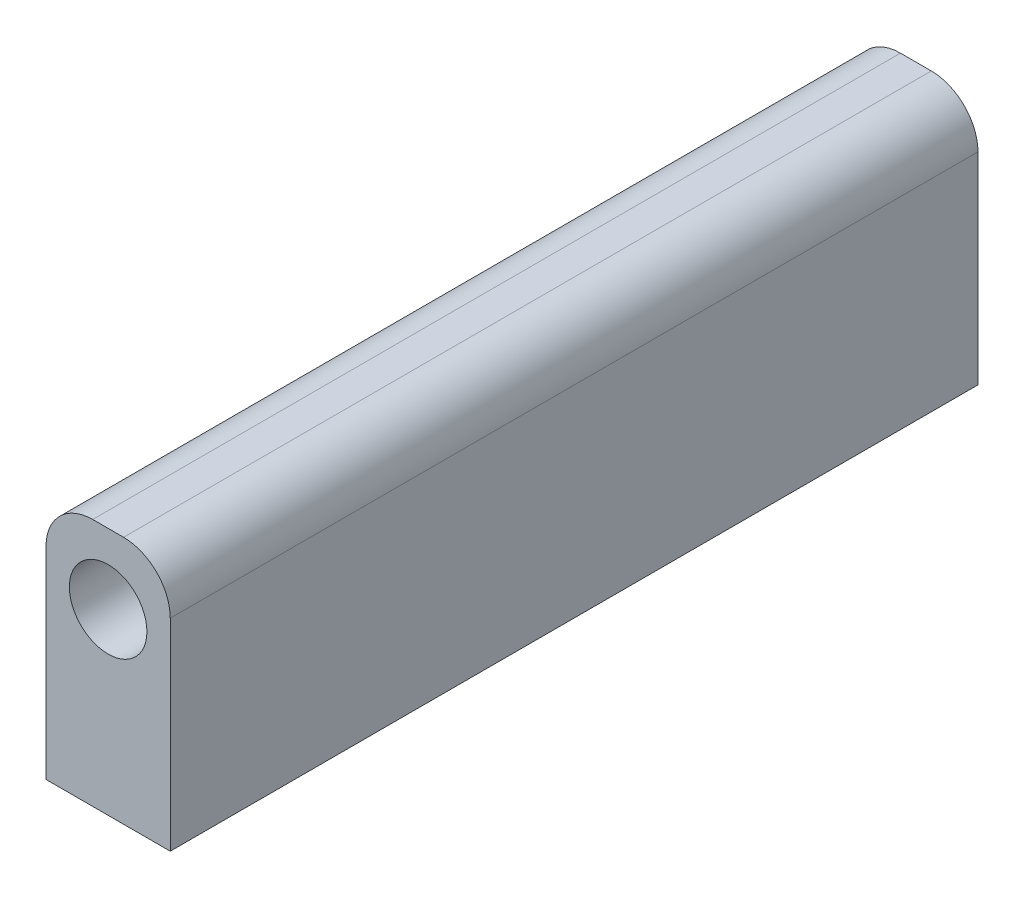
ISO-10303-21;
HEADER;
FILE_DESCRIPTION(('STEP AP214'),'2;1');
FILE_NAME('part.step','',(''),(''),'','','');
FILE_SCHEMA(('AUTOMOTIVE_DESIGN { 1 0 10303 214 1 1 1 1 }'));
ENDSEC;
DATA;
#1=APPLICATION_CONTEXT('core data for automotive mechanical design processes');
#2=APPLICATION_PROTOCOL_DEFINITION('international standard','automotive_design',2000,#1);
#3=PRODUCT_CONTEXT('',#1,'mechanical');
#4=PRODUCT('Part','Part','',(#3));
#5=PRODUCT_RELATED_PRODUCT_CATEGORY('part','',(#4));
#6=PRODUCT_DEFINITION_FORMATION('','',#4);
#7=PRODUCT_DEFINITION_CONTEXT('part definition',#1,'design');
#8=PRODUCT_DEFINITION('design','',#6,#7);
#9=PRODUCT_DEFINITION_SHAPE('','',#8);
#10=(LENGTH_UNIT() NAMED_UNIT(*) SI_UNIT(.MILLI.,.METRE.));
#11=(NAMED_UNIT(*) PLANE_ANGLE_UNIT() SI_UNIT($,.RADIAN.));
#12=(NAMED_UNIT(*) SI_UNIT($,.STERADIAN.) SOLID_ANGLE_UNIT());
#13=UNCERTAINTY_MEASURE_WITH_UNIT(LENGTH_MEASURE(1.E-05),#10,'distance_accuracy_value','');
#14=(GEOMETRIC_REPRESENTATION_CONTEXT(3) GLOBAL_UNCERTAINTY_ASSIGNED_CONTEXT((#13)) GLOBAL_UNIT_ASSIGNED_CONTEXT((#10,
#11,#12)) REPRESENTATION_CONTEXT('',''));
#15=CARTESIAN_POINT('',(0.,0.,0.));
#16=DIRECTION('',(0.,0.,1.));
#17=DIRECTION('',(1.,0.,0.));
#18=AXIS2_PLACEMENT_3D('',#15,#16,#17);
#19=CARTESIAN_POINT('',(0.,0.,41.275));
#20=DIRECTION('',(0.,1.,0.));
#21=DIRECTION('',(0.,0.,1.));
#22=AXIS2_PLACEMENT_3D('',#19,#20,#21);
#23=PLANE('',#22);
#24=CARTESIAN_POINT('',(0.,0.,31.75));
#25=DIRECTION('',(0.,1.,0.));
#26=DIRECTION('',(0.,0.,1.));
#27=AXIS2_PLACEMENT_3D('',#24,#25,#26);
#28=CIRCLE('',#27,3.9624);
#29=CARTESIAN_POINT('',(0.,0.,35.7124));
#30=VERTEX_POINT('',#29);
#31=EDGE_CURVE('E130',#30,#30,#28,.T.);
#32=ORIENTED_EDGE('',*,*,#31,.T.);
#33=EDGE_LOOP('',(#32));
#34=FACE_BOUND('',#33,.T.);
#35=DIRECTION('',(1.,0.,0.));
#36=VECTOR('',#35,1.);
#37=CARTESIAN_POINT('',(0.,0.,-41.275));
#38=LINE('',#37,#36);
#39=CARTESIAN_POINT('',(-6.35,0.,-41.275));
#40=VERTEX_POINT('',#39);
#41=CARTESIAN_POINT('',(6.35,0.,-41.275));
#42=VERTEX_POINT('',#41);
#43=EDGE_CURVE('E174',#40,#42,#38,.T.);
#44=ORIENTED_EDGE('',*,*,#43,.T.);
#45=DIRECTION('',(0.,0.,-1.));
#46=VECTOR('',#45,1.);
#47=CARTESIAN_POINT('',(6.35,0.,41.275));
#48=LINE('',#47,#46);
#49=CARTESIAN_POINT('',(6.35,0.,41.275));
#50=VERTEX_POINT('',#49);
#51=EDGE_CURVE('E173',#50,#42,#48,.T.);
#52=ORIENTED_EDGE('',*,*,#51,.F.);
#53=DIRECTION('',(1.,0.,0.));
#54=VECTOR('',#53,1.);
#55=CARTESIAN_POINT('',(-6.35,0.,41.275));
#56=LINE('',#55,#54);
#57=CARTESIAN_POINT('',(-6.35,0.,41.275));
#58=VERTEX_POINT('',#57);
#59=EDGE_CURVE('E183',#58,#50,#56,.T.);
#60=ORIENTED_EDGE('',*,*,#59,.F.);
#61=DIRECTION('',(0.,0.,-1.));
#62=VECTOR('',#61,1.);
#63=CARTESIAN_POINT('',(-6.35,0.,41.275));
#64=LINE('',#63,#62);
#65=EDGE_CURVE('E184',#58,#40,#64,.T.);
#66=ORIENTED_EDGE('',*,*,#65,.T.);
#67=EDGE_LOOP('',(#44,#52,#60,#66));
#68=FACE_BOUND('',#67,.T.);
#69=CARTESIAN_POINT('',(0.,0.,-31.75));
#70=DIRECTION('',(0.,1.,0.));
#71=DIRECTION('',(0.,0.,1.));
#72=AXIS2_PLACEMENT_3D('',#69,#70,#71);
#73=CIRCLE('',#72,3.9624);
#74=CARTESIAN_POINT('',(0.,0.,-27.7876));
#75=VERTEX_POINT('',#74);
#76=EDGE_CURVE('E201',#75,#75,#73,.T.);
#77=ORIENTED_EDGE('',*,*,#76,.T.);
#78=EDGE_LOOP('',(#77));
#79=FACE_BOUND('',#78,.T.);
#80=ADVANCED_FACE('F33',(#34,#68,#79),#23,.F.);
#81=CARTESIAN_POINT('',(0.,0.,41.275));
#82=DIRECTION('',(0.,0.,1.));
#83=DIRECTION('',(1.,0.,0.));
#84=AXIS2_PLACEMENT_3D('',#81,#82,#83);
#85=PLANE('',#84);
#86=DIRECTION('',(0.,1.,0.));
#87=VECTOR('',#86,1.);
#88=CARTESIAN_POINT('',(6.35,0.,41.275));
#89=LINE('',#88,#87);
#90=CARTESIAN_POINT('',(6.35,20.6248,41.275));
#91=VERTEX_POINT('',#90);
#92=EDGE_CURVE('E152',#50,#91,#89,.T.);
#93=ORIENTED_EDGE('',*,*,#92,.T.);
#94=CARTESIAN_POINT('',(1.5748,20.6248,41.275));
#95=DIRECTION('',(0.,0.,1.));
#96=DIRECTION('',(1.,0.,0.));
#97=AXIS2_PLACEMENT_3D('',#94,#95,#96);
#98=CIRCLE('',#97,4.7752);
#99=CARTESIAN_POINT('',(1.5748,25.4,41.275));
#100=VERTEX_POINT('',#99);
#101=EDGE_CURVE('E41',#91,#100,#98,.T.);
#102=ORIENTED_EDGE('',*,*,#101,.T.);
#103=DIRECTION('',(-1.,0.,0.));
#104=VECTOR('',#103,1.);
#105=CARTESIAN_POINT('',(6.35,25.4,41.275));
#106=LINE('',#105,#104);
#107=CARTESIAN_POINT('',(-1.5748,25.4,41.275));
#108=VERTEX_POINT('',#107);
#109=EDGE_CURVE('E151',#100,#108,#106,.T.);
#110=ORIENTED_EDGE('',*,*,#109,.T.);
#111=CARTESIAN_POINT('',(-1.5748,20.6248,41.275));
#112=DIRECTION('',(0.,0.,1.));
#113=DIRECTION('',(1.,0.,0.));
#114=AXIS2_PLACEMENT_3D('',#111,#112,#113);
#115=CIRCLE('',#114,4.7752);
#116=CARTESIAN_POINT('',(-6.35,20.6248,41.275));
#117=VERTEX_POINT('',#116);
#118=EDGE_CURVE('E48',#108,#117,#115,.T.);
#119=ORIENTED_EDGE('',*,*,#118,.T.);
#120=DIRECTION('',(0.,-1.,0.));
#121=VECTOR('',#120,1.);
#122=CARTESIAN_POINT('',(-6.35,25.4,41.275));
#123=LINE('',#122,#121);
#124=EDGE_CURVE('E160',#117,#58,#123,.T.);
#125=ORIENTED_EDGE('',*,*,#124,.T.);
#126=ORIENTED_EDGE('',*,*,#59,.T.);
#127=EDGE_LOOP('',(#93,#102,#110,#119,#125,#126));
#128=FACE_BOUND('',#127,.T.);
#129=CARTESIAN_POINT('',(0.,18.2372,41.275));
#130=DIRECTION('',(0.,0.,1.));
#131=DIRECTION('',(1.,0.,0.));
#132=AXIS2_PLACEMENT_3D('',#129,#130,#131);
#133=CIRCLE('',#132,3.9624);
#134=CARTESIAN_POINT('',(3.9624,18.2372,41.275));
#135=VERTEX_POINT('',#134);
#136=EDGE_CURVE('E178',#135,#135,#133,.T.);
#137=ORIENTED_EDGE('',*,*,#136,.F.);
#138=EDGE_LOOP('',(#137));
#139=FACE_BOUND('',#138,.T.);
#140=ADVANCED_FACE('F149',(#128,#139),#85,.T.);
#141=CARTESIAN_POINT('',(0.,0.,-41.275));
#142=DIRECTION('',(0.,0.,1.));
#143=DIRECTION('',(1.,0.,0.));
#144=AXIS2_PLACEMENT_3D('',#141,#142,#143);
#145=PLANE('',#144);
#146=DIRECTION('',(-1.,0.,0.));
#147=VECTOR('',#146,1.);
#148=CARTESIAN_POINT('',(6.35,25.4,-41.275));
#149=LINE('',#148,#147);
#150=CARTESIAN_POINT('',(1.5748,25.4,-41.275));
#151=VERTEX_POINT('',#150);
#152=CARTESIAN_POINT('',(-1.5748,25.4,-41.275));
#153=VERTEX_POINT('',#152);
#154=EDGE_CURVE('E169',#151,#153,#149,.T.);
#155=ORIENTED_EDGE('',*,*,#154,.F.);
#156=CARTESIAN_POINT('',(1.5748,20.6248,-41.275));
#157=DIRECTION('',(0.,0.,1.));
#158=DIRECTION('',(1.,0.,0.));
#159=AXIS2_PLACEMENT_3D('',#156,#157,#158);
#160=CIRCLE('',#159,4.7752);
#161=CARTESIAN_POINT('',(6.35,20.6248,-41.275));
#162=VERTEX_POINT('',#161);
#163=EDGE_CURVE('E144',#151,#162,#160,.F.);
#164=ORIENTED_EDGE('',*,*,#163,.T.);
#165=DIRECTION('',(0.,1.,0.));
#166=VECTOR('',#165,1.);
#167=CARTESIAN_POINT('',(6.35,0.,-41.275));
#168=LINE('',#167,#166);
#169=EDGE_CURVE('E168',#42,#162,#168,.T.);
#170=ORIENTED_EDGE('',*,*,#169,.F.);
#171=ORIENTED_EDGE('',*,*,#43,.F.);
#172=DIRECTION('',(0.,-1.,0.));
#173=VECTOR('',#172,1.);
#174=CARTESIAN_POINT('',(-6.35,25.4,-41.275));
#175=LINE('',#174,#173);
#176=CARTESIAN_POINT('',(-6.35,20.6248,-41.275));
#177=VERTEX_POINT('',#176);
#178=EDGE_CURVE('E176',#177,#40,#175,.T.);
#179=ORIENTED_EDGE('',*,*,#178,.F.);
#180=CARTESIAN_POINT('',(-1.5748,20.6248,-41.275));
#181=DIRECTION('',(0.,0.,1.));
#182=DIRECTION('',(1.,0.,0.));
#183=AXIS2_PLACEMENT_3D('',#180,#181,#182);
#184=CIRCLE('',#183,4.7752);
#185=EDGE_CURVE('E142',#177,#153,#184,.F.);
#186=ORIENTED_EDGE('',*,*,#185,.T.);
#187=EDGE_LOOP('',(#155,#164,#170,#171,#179,#186));
#188=FACE_BOUND('',#187,.T.);
#189=CARTESIAN_POINT('',(0.,18.2372,-41.275));
#190=DIRECTION('',(0.,0.,1.));
#191=DIRECTION('',(1.,0.,0.));
#192=AXIS2_PLACEMENT_3D('',#189,#190,#191);
#193=CIRCLE('',#192,3.9624);
#194=CARTESIAN_POINT('',(3.9624,18.2372,-41.275));
#195=VERTEX_POINT('',#194);
#196=EDGE_CURVE('E208',#195,#195,#193,.T.);
#197=ORIENTED_EDGE('',*,*,#196,.T.);
#198=EDGE_LOOP('',(#197));
#199=FACE_BOUND('',#198,.T.);
#200=ADVANCED_FACE('F165',(#188,#199),#145,.F.);
#201=CARTESIAN_POINT('',(6.35,0.,41.275));
#202=DIRECTION('',(-1.,0.,0.));
#203=DIRECTION('',(0.,0.,1.));
#204=AXIS2_PLACEMENT_3D('',#201,#202,#203);
#205=PLANE('',#204);
#206=ORIENTED_EDGE('',*,*,#169,.T.);
#207=DIRECTION('',(0.,0.,-1.));
#208=VECTOR('',#207,1.);
#209=CARTESIAN_POINT('',(6.35,20.6248,41.275));
#210=LINE('',#209,#208);
#211=EDGE_CURVE('E56',#162,#91,#210,.F.);
#212=ORIENTED_EDGE('',*,*,#211,.T.);
#213=ORIENTED_EDGE('',*,*,#92,.F.);
#214=ORIENTED_EDGE('',*,*,#51,.T.);
#215=EDGE_LOOP('',(#206,#212,#213,#214));
#216=FACE_BOUND('',#215,.T.);
#217=ADVANCED_FACE('F171',(#216),#205,.F.);
#218=CARTESIAN_POINT('',(6.35,25.4,41.275));
#219=DIRECTION('',(0.,-1.,0.));
#220=DIRECTION('',(0.,0.,-1.));
#221=AXIS2_PLACEMENT_3D('',#218,#219,#220);
#222=PLANE('',#221);
#223=ORIENTED_EDGE('',*,*,#109,.F.);
#224=DIRECTION('',(0.,0.,-1.));
#225=VECTOR('',#224,1.);
#226=CARTESIAN_POINT('',(1.5748,25.4,41.275));
#227=LINE('',#226,#225);
#228=EDGE_CURVE('E136',#100,#151,#227,.T.);
#229=ORIENTED_EDGE('',*,*,#228,.T.);
#230=ORIENTED_EDGE('',*,*,#154,.T.);
#231=DIRECTION('',(0.,0.,-1.));
#232=VECTOR('',#231,1.);
#233=CARTESIAN_POINT('',(-1.5748,25.4,41.275));
#234=LINE('',#233,#232);
#235=EDGE_CURVE('E134',#153,#108,#234,.F.);
#236=ORIENTED_EDGE('',*,*,#235,.T.);
#237=EDGE_LOOP('',(#223,#229,#230,#236));
#238=FACE_BOUND('',#237,.T.);
#239=ADVANCED_FACE('F156',(#238),#222,.F.);
#240=CARTESIAN_POINT('',(-6.35,25.4,41.275));
#241=DIRECTION('',(1.,0.,0.));
#242=DIRECTION('',(0.,1.,0.));
#243=AXIS2_PLACEMENT_3D('',#240,#241,#242);
#244=PLANE('',#243);
#245=ORIENTED_EDGE('',*,*,#124,.F.);
#246=DIRECTION('',(0.,0.,-1.));
#247=VECTOR('',#246,1.);
#248=CARTESIAN_POINT('',(-6.35,20.6248,41.275));
#249=LINE('',#248,#247);
#250=EDGE_CURVE('E11',#117,#177,#249,.T.);
#251=ORIENTED_EDGE('',*,*,#250,.T.);
#252=ORIENTED_EDGE('',*,*,#178,.T.);
#253=ORIENTED_EDGE('',*,*,#65,.F.);
#254=EDGE_LOOP('',(#245,#251,#252,#253));
#255=FACE_BOUND('',#254,.T.);
#256=ADVANCED_FACE('F221',(#255),#244,.F.);
#257=CARTESIAN_POINT('',(0.,18.2372,41.275));
#258=DIRECTION('',(0.,0.,-1.));
#259=DIRECTION('',(-1.,0.,0.));
#260=AXIS2_PLACEMENT_3D('',#257,#258,#259);
#261=CYLINDRICAL_SURFACE('',#260,3.9624);
#262=DIRECTION('',(0.,0.,-1.));
#263=VECTOR('',#262,1.);
#264=CARTESIAN_POINT('',(3.18129296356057,15.875,41.275));
#265=LINE('',#264,#263);
#266=CARTESIAN_POINT('',(3.18129296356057,15.875,-29.3878));
#267=VERTEX_POINT('',#266);
#268=CARTESIAN_POINT('',(3.18129296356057,15.875,-34.1122));
#269=VERTEX_POINT('',#268);
#270=EDGE_CURVE('E125',#267,#269,#265,.T.);
#271=ORIENTED_EDGE('',*,*,#270,.F.);
#272=CARTESIAN_POINT('',(0.,18.2372,-31.75));
#273=DIRECTION('',(0.,-0.707106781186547,-0.707106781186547));
#274=DIRECTION('',(0.,0.707106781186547,-0.707106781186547));
#275=AXIS2_PLACEMENT_3D('',#272,#273,#274);
#276=ELLIPSE('',#275,5.60367981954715,3.9624);
#277=CARTESIAN_POINT('',(-3.18129296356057,15.875,-29.3878));
#278=VERTEX_POINT('',#277);
#279=EDGE_CURVE('E114',#267,#278,#276,.T.);
#280=ORIENTED_EDGE('',*,*,#279,.T.);
#281=DIRECTION('',(0.,0.,-1.));
#282=VECTOR('',#281,1.);
#283=CARTESIAN_POINT('',(-3.18129296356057,15.875,41.275));
#284=LINE('',#283,#282);
#285=CARTESIAN_POINT('',(-3.18129296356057,15.875,-34.1122));
#286=VERTEX_POINT('',#285);
#287=EDGE_CURVE('E198',#286,#278,#284,.F.);
#288=ORIENTED_EDGE('',*,*,#287,.F.);
#289=CARTESIAN_POINT('',(0.,18.2372,-31.75));
#290=DIRECTION('',(0.,0.707106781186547,-0.707106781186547));
#291=DIRECTION('',(0.,-0.707106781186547,-0.707106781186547));
#292=AXIS2_PLACEMENT_3D('',#289,#290,#291);
#293=ELLIPSE('',#292,5.60367981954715,3.9624);
#294=EDGE_CURVE('E126',#286,#269,#293,.F.);
#295=ORIENTED_EDGE('',*,*,#294,.T.);
#296=EDGE_LOOP('',(#271,#280,#288,#295));
#297=FACE_BOUND('',#296,.T.);
#298=DIRECTION('',(0.,0.,-1.));
#299=VECTOR('',#298,1.);
#300=CARTESIAN_POINT('',(3.18129296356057,15.875,41.275));
#301=LINE('',#300,#299);
#302=CARTESIAN_POINT('',(3.18129296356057,15.875,34.1122));
#303=VERTEX_POINT('',#302);
#304=CARTESIAN_POINT('',(3.18129296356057,15.875,29.3878));
#305=VERTEX_POINT('',#304);
#306=EDGE_CURVE('E196',#303,#305,#301,.T.);
#307=ORIENTED_EDGE('',*,*,#306,.F.);
#308=CARTESIAN_POINT('',(0.,18.2372,31.75));
#309=DIRECTION('',(0.,-0.707106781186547,-0.707106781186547));
#310=DIRECTION('',(0.,0.707106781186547,-0.707106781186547));
#311=AXIS2_PLACEMENT_3D('',#308,#309,#310);
#312=ELLIPSE('',#311,5.60367981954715,3.9624);
#313=CARTESIAN_POINT('',(-3.18129296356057,15.875,34.1122));
#314=VERTEX_POINT('',#313);
#315=EDGE_CURVE('E193',#303,#314,#312,.T.);
#316=ORIENTED_EDGE('',*,*,#315,.T.);
#317=DIRECTION('',(0.,0.,-1.));
#318=VECTOR('',#317,1.);
#319=CARTESIAN_POINT('',(-3.18129296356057,15.875,41.275));
#320=LINE('',#319,#318);
#321=CARTESIAN_POINT('',(-3.18129296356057,15.875,29.3878));
#322=VERTEX_POINT('',#321);
#323=EDGE_CURVE('E188',#322,#314,#320,.F.);
#324=ORIENTED_EDGE('',*,*,#323,.F.);
#325=CARTESIAN_POINT('',(0.,18.2372,31.75));
#326=DIRECTION('',(0.,0.707106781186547,-0.707106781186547));
#327=DIRECTION('',(0.,-0.707106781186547,-0.707106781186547));
#328=AXIS2_PLACEMENT_3D('',#325,#326,#327);
#329=ELLIPSE('',#328,5.60367981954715,3.9624);
#330=EDGE_CURVE('E190',#322,#305,#329,.F.);
#331=ORIENTED_EDGE('',*,*,#330,.T.);
#332=EDGE_LOOP('',(#307,#316,#324,#331));
#333=FACE_BOUND('',#332,.T.);
#334=ORIENTED_EDGE('',*,*,#136,.T.);
#335=EDGE_LOOP('',(#334));
#336=FACE_BOUND('',#335,.T.);
#337=ORIENTED_EDGE('',*,*,#196,.F.);
#338=EDGE_LOOP('',(#337));
#339=FACE_BOUND('',#338,.T.);
#340=ADVANCED_FACE('F132',(#297,#333,#336,#339),#261,.F.);
#341=CARTESIAN_POINT('',(0.,15.875,31.75));
#342=DIRECTION('',(0.,1.,0.));
#343=DIRECTION('',(0.,0.,1.));
#344=AXIS2_PLACEMENT_3D('',#341,#342,#343);
#345=PLANE('',#344);
#346=ORIENTED_EDGE('',*,*,#306,.T.);
#347=CARTESIAN_POINT('',(0.,15.875,31.75));
#348=DIRECTION('',(0.,1.,0.));
#349=DIRECTION('',(0.,0.,1.));
#350=AXIS2_PLACEMENT_3D('',#347,#348,#349);
#351=CIRCLE('',#350,3.9624);
#352=EDGE_CURVE('E205',#303,#305,#351,.T.);
#353=ORIENTED_EDGE('',*,*,#352,.F.);
#354=EDGE_LOOP('',(#346,#353));
#355=FACE_BOUND('',#354,.T.);
#356=ADVANCED_FACE('F248',(#355),#345,.F.);
#357=CARTESIAN_POINT('',(0.,15.875,31.75));
#358=DIRECTION('',(0.,-1.,0.));
#359=DIRECTION('',(0.,0.,-1.));
#360=AXIS2_PLACEMENT_3D('',#357,#358,#359);
#361=CYLINDRICAL_SURFACE('',#360,3.9624);
#362=ORIENTED_EDGE('',*,*,#352,.T.);
#363=ORIENTED_EDGE('',*,*,#330,.F.);
#364=EDGE_CURVE('E209',#322,#314,#351,.T.);
#365=ORIENTED_EDGE('',*,*,#364,.T.);
#366=ORIENTED_EDGE('',*,*,#315,.F.);
#367=EDGE_LOOP('',(#362,#363,#365,#366));
#368=FACE_BOUND('',#367,.T.);
#369=ORIENTED_EDGE('',*,*,#31,.F.);
#370=EDGE_LOOP('',(#369));
#371=FACE_BOUND('',#370,.T.);
#372=ADVANCED_FACE('F249',(#368,#371),#361,.F.);
#373=ORIENTED_EDGE('',*,*,#323,.T.);
#374=ORIENTED_EDGE('',*,*,#364,.F.);
#375=EDGE_LOOP('',(#373,#374));
#376=FACE_BOUND('',#375,.T.);
#377=ADVANCED_FACE('F252',(#376),#345,.F.);
#378=CARTESIAN_POINT('',(0.,15.875,-31.75));
#379=DIRECTION('',(0.,1.,0.));
#380=DIRECTION('',(0.,0.,1.));
#381=AXIS2_PLACEMENT_3D('',#378,#379,#380);
#382=PLANE('',#381);
#383=ORIENTED_EDGE('',*,*,#270,.T.);
#384=CARTESIAN_POINT('',(0.,15.875,-31.75));
#385=DIRECTION('',(0.,1.,0.));
#386=DIRECTION('',(0.,0.,1.));
#387=AXIS2_PLACEMENT_3D('',#384,#385,#386);
#388=CIRCLE('',#387,3.9624);
#389=EDGE_CURVE('E119',#267,#269,#388,.T.);
#390=ORIENTED_EDGE('',*,*,#389,.F.);
#391=EDGE_LOOP('',(#383,#390));
#392=FACE_BOUND('',#391,.T.);
#393=ADVANCED_FACE('F129',(#392),#382,.F.);
#394=CARTESIAN_POINT('',(0.,15.875,-31.75));
#395=DIRECTION('',(0.,-1.,0.));
#396=DIRECTION('',(0.,0.,-1.));
#397=AXIS2_PLACEMENT_3D('',#394,#395,#396);
#398=CYLINDRICAL_SURFACE('',#397,3.9624);
#399=ORIENTED_EDGE('',*,*,#389,.T.);
#400=ORIENTED_EDGE('',*,*,#294,.F.);
#401=EDGE_CURVE('E121',#286,#278,#388,.T.);
#402=ORIENTED_EDGE('',*,*,#401,.T.);
#403=ORIENTED_EDGE('',*,*,#279,.F.);
#404=EDGE_LOOP('',(#399,#400,#402,#403));
#405=FACE_BOUND('',#404,.T.);
#406=ORIENTED_EDGE('',*,*,#76,.F.);
#407=EDGE_LOOP('',(#406));
#408=FACE_BOUND('',#407,.T.);
#409=ADVANCED_FACE('F116',(#405,#408),#398,.F.);
#410=ORIENTED_EDGE('',*,*,#287,.T.);
#411=ORIENTED_EDGE('',*,*,#401,.F.);
#412=EDGE_LOOP('',(#410,#411));
#413=FACE_BOUND('',#412,.T.);
#414=ADVANCED_FACE('F200',(#413),#382,.F.);
#415=CARTESIAN_POINT('',(1.5748,20.6248,41.275));
#416=DIRECTION('',(0.,0.,-1.));
#417=DIRECTION('',(-1.,0.,0.));
#418=AXIS2_PLACEMENT_3D('',#415,#416,#417);
#419=CYLINDRICAL_SURFACE('',#418,4.7752);
#420=ORIENTED_EDGE('',*,*,#101,.F.);
#421=ORIENTED_EDGE('',*,*,#211,.F.);
#422=ORIENTED_EDGE('',*,*,#163,.F.);
#423=ORIENTED_EDGE('',*,*,#228,.F.);
#424=EDGE_LOOP('',(#420,#421,#422,#423));
#425=FACE_BOUND('',#424,.T.);
#426=ADVANCED_FACE('F162',(#425),#419,.T.);
#427=CARTESIAN_POINT('',(-1.5748,20.6248,41.275));
#428=DIRECTION('',(0.,0.,-1.));
#429=DIRECTION('',(-1.,0.,0.));
#430=AXIS2_PLACEMENT_3D('',#427,#428,#429);
#431=CYLINDRICAL_SURFACE('',#430,4.7752);
#432=ORIENTED_EDGE('',*,*,#118,.F.);
#433=ORIENTED_EDGE('',*,*,#235,.F.);
#434=ORIENTED_EDGE('',*,*,#185,.F.);
#435=ORIENTED_EDGE('',*,*,#250,.F.);
#436=EDGE_LOOP('',(#432,#433,#434,#435));
#437=FACE_BOUND('',#436,.T.);
#438=ADVANCED_FACE('F35',(#437),#431,.T.);
#439=CLOSED_SHELL('',(#80,#140,#200,#217,#239,#256,#340,#356,#372,#377,#393,#409,#414,#426,#438));
#440=MANIFOLD_SOLID_BREP('B2',#439);
#441=ADVANCED_BREP_SHAPE_REPRESENTATION('',(#18,#440),#14);
#442=SHAPE_DEFINITION_REPRESENTATION(#9,#441);
ENDSEC;
END-ISO-10303-21;
